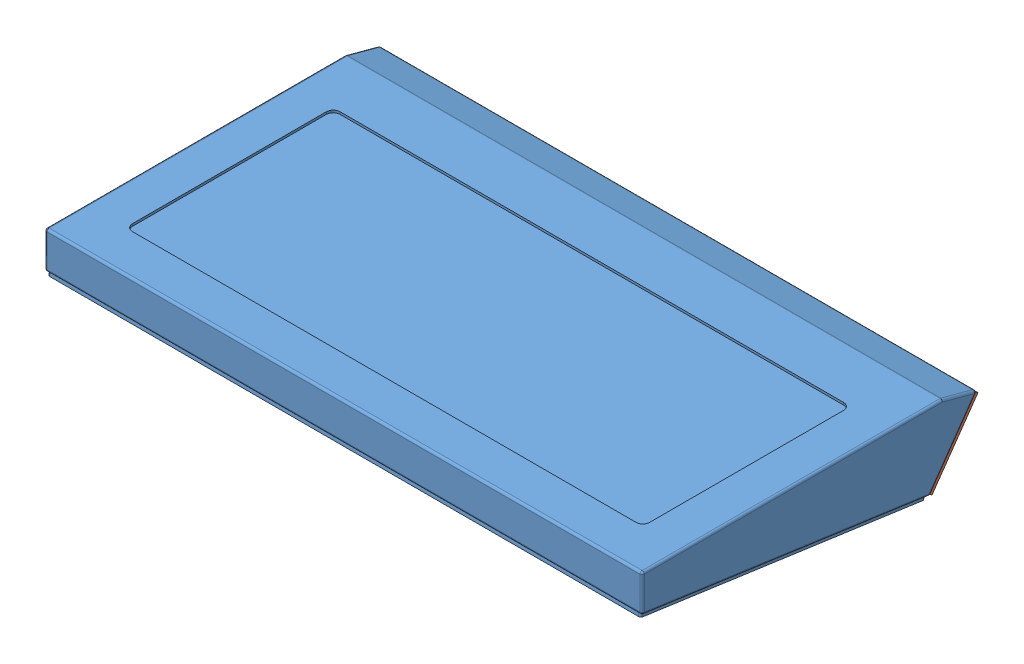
SolidWorks assembly Panel Mount Keyboard, KB-xx-W35.SLDASM, configuration Default (file format 10000). Lengths in mm.
Overall size (416.56 94.69 307.01).
7 component instances, 4 part files, 6 mates.
Components (placement in the parent):
- Keyboard Enclosure, KB-xx-W35-1: Keyboard Enclosure, KB-xx-W35.SLDPRT [Default] at (-2.8236 61.6302 -64.2609) size (416.56 94.69 307.01)
- Collar, 11167-2: Collar, 11167.SLDPRT [Default] at (-2.8236 5.7563 -54.8954) x (1 0 0) z (0 -0.573576 -0.819152) size (414.02 55.88 11.76)
- Gasket, 10459-1: Gasket, 10459.sldprt [Default] at (-1063.8335 -410.6594 234.8215) x (1 0 0) z (0 0.573576 0.819152) size (411.07 54.97 2.03)
- Hex Head Cap Screw, 30521-1: Hex Head Cap Screw, 30521.SLDPRT [91287A138] at (174.9764 46.0353 -82.2096) x (0 0.573576 0.819152) z (-0.819152 -0.469846 0.32899) size (29.43 11.55 10)
- Hex Head Cap Screw, 30521-2: Hex Head Cap Screw, 30521.SLDPRT [91287A138] at (174.9764 15.9908 -61.1722) x (0 0.573576 0.819152) z (-0.660357 -0.615144 0.430728) size (29.43 11.55 10)
- Hex Head Cap Screw, 30521-3: Hex Head Cap Screw, 30521.SLDPRT [91287A138] at (-180.6236 46.0353 -82.2096) x (0 0.573576 0.819152) z (-0.475203 -0.720753 0.504676) size (29.43 11.55 10)
- Hex Head Cap Screw, 30521-4: Hex Head Cap Screw, 30521.SLDPRT [91287A138] at (-180.6236 15.9908 -61.1722) x (0 0.573576 0.819152) z (-0.284661 -0.785262 0.549847) size (29.43 11.55 10)
Mates (geometry in assembly coordinates):
- Coincident1: coincident anti-aligned: plane of Keyboard Enclosure, KB-xx-W35-1 through (205.4564 55.0562 -88.7954) normal (0 -0.573576 -0.819152); plane of Gasket, 10459-1 through (-2.8126 30.8865 -71.8716) normal (0 0.573576 0.819152)
- Concentric1: concentric aligned: cylinder of Keyboard Enclosure, KB-xx-W35-1 through (174.9764 45.9088 -82.3903) axis (0 -0.573576 -0.819152) radius 2.5; cylinder of Gasket, 10459-1 through (174.9764 44.7433 -84.0548) axis (0 -0.573576 -0.819152) radius 2.9718
- Parallel1: parallel anti-aligned: line of Keyboard Enclosure, KB-xx-W35-1 through (-209.5796 53.2734 -87.547) axis (1 0 0); line of Gasket, 10459-1 through (201.1384 52.2336 -89.2996) axis (-1 0 0)
- Distance1: distance = 1.524 mm anti-aligned: plane of Collar, 11167-2 through (-2.8236 5.7563 -54.8954) normal (0 0.573576 0.819152); plane of Gasket, 10459-1 through (-2.8126 29.721 -73.5361) normal (0 -0.573576 -0.819152)
- Concentric2: concentric aligned: circle of Gasket, 10459-1; cylinder of Collar, 11167-2 through (174.9764 45.6174 -82.8064) axis (0 -0.573576 -0.819152) radius 4.0005
- Parallel2: parallel anti-aligned: line of Keyboard Enclosure, KB-xx-W35-1 through (203.9324 55.6196 -86.6931) axis (-1 0 0); line of Collar, 11167-2 through (-209.8336 52.1754 -90.1798) axis (1 0 0)
